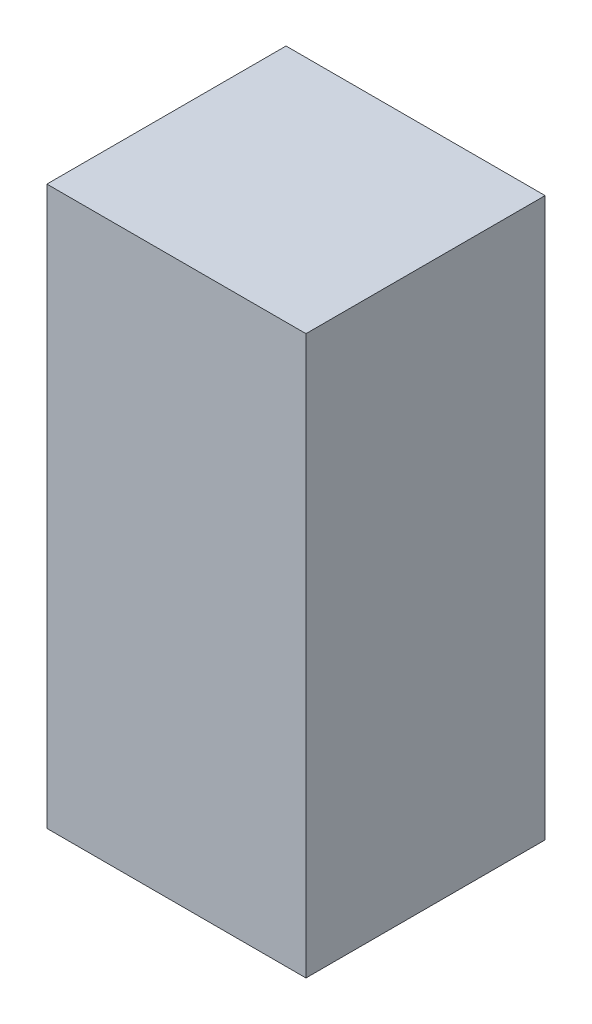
from build123d import *

# Parameters (mm, degrees)
EXTRUSION1_DEPTH      = 3.245211
EXTRUSION1_DEPTH_BACK = 2.754789
ESQUISSE1_W           = 6.5
ESQUISSE1_H           = 14


with BuildPart() as part:
    # Esquisse1 → Extrusion1 (new, two sides: drawn at the far end of the back side and taken through both)
    with BuildSketch(Plane.XY.offset(-EXTRUSION1_DEPTH_BACK)):
        with Locations((11.95, 13.863984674)):
            Rectangle(ESQUISSE1_W, ESQUISSE1_H)
    extrude(amount=EXTRUSION1_DEPTH + EXTRUSION1_DEPTH_BACK)


solid = part.part
